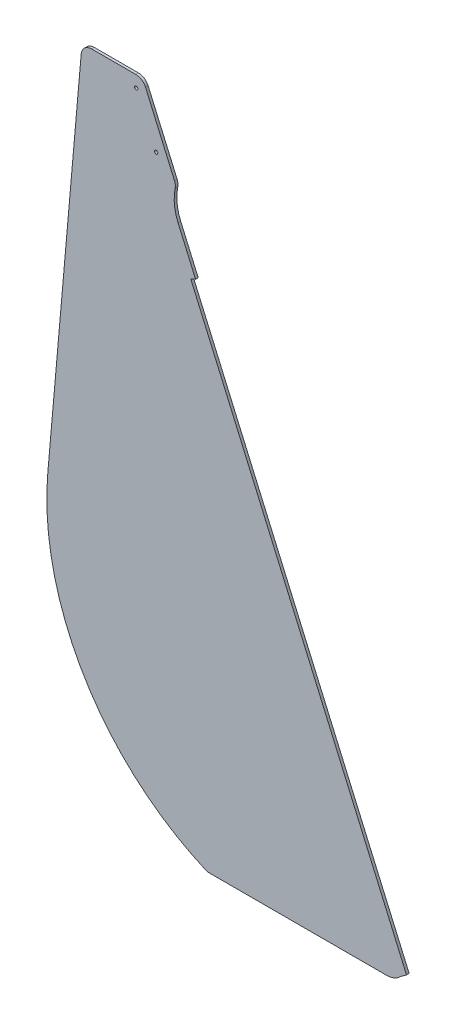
ISO-10303-21;
HEADER;
FILE_DESCRIPTION(('STEP AP214'),'2;1');
FILE_NAME('part.step','',(''),(''),'','','');
FILE_SCHEMA(('AUTOMOTIVE_DESIGN { 1 0 10303 214 1 1 1 1 }'));
ENDSEC;
DATA;
#1=APPLICATION_CONTEXT('core data for automotive mechanical design processes');
#2=APPLICATION_PROTOCOL_DEFINITION('international standard','automotive_design',2000,#1);
#3=PRODUCT_CONTEXT('',#1,'mechanical');
#4=PRODUCT('Part','Part','',(#3));
#5=PRODUCT_RELATED_PRODUCT_CATEGORY('part','',(#4));
#6=PRODUCT_DEFINITION_FORMATION('','',#4);
#7=PRODUCT_DEFINITION_CONTEXT('part definition',#1,'design');
#8=PRODUCT_DEFINITION('design','',#6,#7);
#9=PRODUCT_DEFINITION_SHAPE('','',#8);
#10=(LENGTH_UNIT() NAMED_UNIT(*) SI_UNIT(.MILLI.,.METRE.));
#11=(NAMED_UNIT(*) PLANE_ANGLE_UNIT() SI_UNIT($,.RADIAN.));
#12=(NAMED_UNIT(*) SI_UNIT($,.STERADIAN.) SOLID_ANGLE_UNIT());
#13=UNCERTAINTY_MEASURE_WITH_UNIT(LENGTH_MEASURE(1.E-05),#10,'distance_accuracy_value','');
#14=(GEOMETRIC_REPRESENTATION_CONTEXT(3) GLOBAL_UNCERTAINTY_ASSIGNED_CONTEXT((#13)) GLOBAL_UNIT_ASSIGNED_CONTEXT((#10,
#11,#12)) REPRESENTATION_CONTEXT('',''));
#15=CARTESIAN_POINT('',(0.,0.,0.));
#16=DIRECTION('',(0.,0.,1.));
#17=DIRECTION('',(1.,0.,0.));
#18=AXIS2_PLACEMENT_3D('',#15,#16,#17);
#19=CARTESIAN_POINT('',(-107.603189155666,388.77551950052,3.175));
#20=DIRECTION('',(0.,0.,-1.));
#21=DIRECTION('',(-1.,0.,0.));
#22=AXIS2_PLACEMENT_3D('',#19,#20,#21);
#23=CYLINDRICAL_SURFACE('',#22,56.7389009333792);
#24=CARTESIAN_POINT('',(-107.603189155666,388.77551950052,0.));
#25=DIRECTION('',(0.,0.,-1.));
#26=DIRECTION('',(-1.,0.,0.));
#27=AXIS2_PLACEMENT_3D('',#24,#25,#26);
#28=CIRCLE('',#27,56.7389009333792);
#29=CARTESIAN_POINT('',(-159.613848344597,366.099668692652,0.));
#30=VERTEX_POINT('',#29);
#31=CARTESIAN_POINT('',(-163.173742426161,400.230496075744,0.));
#32=VERTEX_POINT('',#31);
#33=EDGE_CURVE('E164',#30,#32,#28,.T.);
#34=ORIENTED_EDGE('',*,*,#33,.T.);
#35=DIRECTION('',(0.,0.,-1.));
#36=VECTOR('',#35,1.);
#37=CARTESIAN_POINT('',(-163.173742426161,400.230496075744,3.175));
#38=LINE('',#37,#36);
#39=CARTESIAN_POINT('',(-163.173742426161,400.230496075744,3.175));
#40=VERTEX_POINT('',#39);
#41=EDGE_CURVE('E47',#40,#32,#38,.T.);
#42=ORIENTED_EDGE('',*,*,#41,.F.);
#43=CARTESIAN_POINT('',(-107.603189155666,388.77551950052,3.175));
#44=DIRECTION('',(0.,0.,-1.));
#45=DIRECTION('',(-1.,0.,0.));
#46=AXIS2_PLACEMENT_3D('',#43,#44,#45);
#47=CIRCLE('',#46,56.7389009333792);
#48=CARTESIAN_POINT('',(-159.613848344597,366.099668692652,3.175));
#49=VERTEX_POINT('',#48);
#50=EDGE_CURVE('E315',#49,#40,#47,.T.);
#51=ORIENTED_EDGE('',*,*,#50,.F.);
#52=DIRECTION('',(0.,0.,-1.));
#53=VECTOR('',#52,1.);
#54=CARTESIAN_POINT('',(-159.613848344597,366.099668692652,3.175));
#55=LINE('',#54,#53);
#56=EDGE_CURVE('E11',#49,#30,#55,.T.);
#57=ORIENTED_EDGE('',*,*,#56,.T.);
#58=EDGE_LOOP('',(#34,#42,#51,#57));
#59=FACE_BOUND('',#58,.T.);
#60=ADVANCED_FACE('F38',(#59),#23,.F.);
#61=CARTESIAN_POINT('',(-175.612228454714,402.794490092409,3.175));
#62=DIRECTION('',(0.,0.,-1.));
#63=DIRECTION('',(-1.,0.,0.));
#64=AXIS2_PLACEMENT_3D('',#61,#62,#63);
#65=CYLINDRICAL_SURFACE('',#64,12.7);
#66=CARTESIAN_POINT('',(-175.612228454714,402.794490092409,0.));
#67=DIRECTION('',(0.,0.,1.));
#68=DIRECTION('',(1.,0.,0.));
#69=AXIS2_PLACEMENT_3D('',#66,#67,#68);
#70=CIRCLE('',#69,12.7);
#71=CARTESIAN_POINT('',(-163.970561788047,407.870078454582,0.));
#72=VERTEX_POINT('',#71);
#73=EDGE_CURVE('E167',#32,#72,#70,.T.);
#74=ORIENTED_EDGE('',*,*,#73,.T.);
#75=DIRECTION('',(0.,0.,-1.));
#76=VECTOR('',#75,1.);
#77=CARTESIAN_POINT('',(-163.970561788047,407.870078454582,3.175));
#78=LINE('',#77,#76);
#79=CARTESIAN_POINT('',(-163.970561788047,407.870078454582,3.175));
#80=VERTEX_POINT('',#79);
#81=EDGE_CURVE('E204',#80,#72,#78,.T.);
#82=ORIENTED_EDGE('',*,*,#81,.F.);
#83=CARTESIAN_POINT('',(-175.612228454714,402.794490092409,3.175));
#84=DIRECTION('',(0.,0.,1.));
#85=DIRECTION('',(1.,0.,0.));
#86=AXIS2_PLACEMENT_3D('',#83,#84,#85);
#87=CIRCLE('',#86,12.7);
#88=EDGE_CURVE('E213',#40,#80,#87,.T.);
#89=ORIENTED_EDGE('',*,*,#88,.F.);
#90=ORIENTED_EDGE('',*,*,#41,.T.);
#91=EDGE_LOOP('',(#74,#82,#89,#90));
#92=FACE_BOUND('',#91,.T.);
#93=ADVANCED_FACE('F211',(#92),#65,.T.);
#94=CARTESIAN_POINT('',(-163.970561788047,407.870078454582,3.175));
#95=DIRECTION('',(-0.916666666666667,-0.399652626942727,0.));
#96=DIRECTION('',(0.399652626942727,-0.916666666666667,0.));
#97=AXIS2_PLACEMENT_3D('',#94,#95,#96);
#98=PLANE('',#97);
#99=DIRECTION('',(-0.399652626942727,0.916666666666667,0.));
#100=VECTOR('',#99,1.);
#101=CARTESIAN_POINT('',(-163.970561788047,407.870078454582,0.));
#102=LINE('',#101,#100);
#103=CARTESIAN_POINT('',(-198.764541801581,487.675588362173,0.));
#104=VERTEX_POINT('',#103);
#105=EDGE_CURVE('E170',#72,#104,#102,.T.);
#106=ORIENTED_EDGE('',*,*,#105,.T.);
#107=DIRECTION('',(0.,0.,-1.));
#108=VECTOR('',#107,1.);
#109=CARTESIAN_POINT('',(-198.764541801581,487.675588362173,3.175));
#110=LINE('',#109,#108);
#111=CARTESIAN_POINT('',(-198.764541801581,487.675588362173,3.175));
#112=VERTEX_POINT('',#111);
#113=EDGE_CURVE('E201',#112,#104,#110,.T.);
#114=ORIENTED_EDGE('',*,*,#113,.F.);
#115=DIRECTION('',(-0.399652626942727,0.916666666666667,0.));
#116=VECTOR('',#115,1.);
#117=CARTESIAN_POINT('',(-163.970561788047,407.870078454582,3.175));
#118=LINE('',#117,#116);
#119=EDGE_CURVE('E236',#80,#112,#118,.T.);
#120=ORIENTED_EDGE('',*,*,#119,.F.);
#121=ORIENTED_EDGE('',*,*,#81,.T.);
#122=EDGE_LOOP('',(#106,#114,#120,#121));
#123=FACE_BOUND('',#122,.T.);
#124=ADVANCED_FACE('F227',(#123),#98,.F.);
#125=CARTESIAN_POINT('',(-210.406208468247,482.6,3.175));
#126=DIRECTION('',(0.,0.,-1.));
#127=DIRECTION('',(-1.,0.,0.));
#128=AXIS2_PLACEMENT_3D('',#125,#126,#127);
#129=CYLINDRICAL_SURFACE('',#128,12.6999999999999);
#130=CARTESIAN_POINT('',(-210.406208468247,482.6,0.));
#131=DIRECTION('',(0.,0.,1.));
#132=DIRECTION('',(1.,0.,0.));
#133=AXIS2_PLACEMENT_3D('',#130,#131,#132);
#134=CIRCLE('',#133,12.6999999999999);
#135=CARTESIAN_POINT('',(-210.406208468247,495.3,0.));
#136=VERTEX_POINT('',#135);
#137=EDGE_CURVE('E172',#104,#136,#134,.T.);
#138=ORIENTED_EDGE('',*,*,#137,.T.);
#139=DIRECTION('',(0.,0.,-1.));
#140=VECTOR('',#139,1.);
#141=CARTESIAN_POINT('',(-210.406208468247,495.3,3.175));
#142=LINE('',#141,#140);
#143=CARTESIAN_POINT('',(-210.406208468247,495.3,3.175));
#144=VERTEX_POINT('',#143);
#145=EDGE_CURVE('E198',#144,#136,#142,.T.);
#146=ORIENTED_EDGE('',*,*,#145,.F.);
#147=CARTESIAN_POINT('',(-210.406208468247,482.6,3.175));
#148=DIRECTION('',(0.,0.,1.));
#149=DIRECTION('',(1.,0.,0.));
#150=AXIS2_PLACEMENT_3D('',#147,#148,#149);
#151=CIRCLE('',#150,12.6999999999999);
#152=EDGE_CURVE('E233',#112,#144,#151,.T.);
#153=ORIENTED_EDGE('',*,*,#152,.F.);
#154=ORIENTED_EDGE('',*,*,#113,.T.);
#155=EDGE_LOOP('',(#138,#146,#153,#154));
#156=FACE_BOUND('',#155,.T.);
#157=ADVANCED_FACE('F231',(#156),#129,.T.);
#158=CARTESIAN_POINT('',(-263.487147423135,495.3,3.175));
#159=DIRECTION('',(0.,-1.,0.));
#160=DIRECTION('',(0.,0.,-1.));
#161=AXIS2_PLACEMENT_3D('',#158,#159,#160);
#162=PLANE('',#161);
#163=DIRECTION('',(-1.,0.,0.));
#164=VECTOR('',#163,1.);
#165=CARTESIAN_POINT('',(-263.487147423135,495.3,0.));
#166=LINE('',#165,#164);
#167=CARTESIAN_POINT('',(-263.487147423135,495.3,0.));
#168=VERTEX_POINT('',#167);
#169=EDGE_CURVE('E174',#136,#168,#166,.T.);
#170=ORIENTED_EDGE('',*,*,#169,.T.);
#171=DIRECTION('',(0.,0.,-1.));
#172=VECTOR('',#171,1.);
#173=CARTESIAN_POINT('',(-263.487147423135,495.3,3.175));
#174=LINE('',#173,#172);
#175=CARTESIAN_POINT('',(-263.487147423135,495.3,3.175));
#176=VERTEX_POINT('',#175);
#177=EDGE_CURVE('E195',#176,#168,#174,.T.);
#178=ORIENTED_EDGE('',*,*,#177,.F.);
#179=DIRECTION('',(-1.,0.,0.));
#180=VECTOR('',#179,1.);
#181=CARTESIAN_POINT('',(-263.487147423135,495.3,3.175));
#182=LINE('',#181,#180);
#183=EDGE_CURVE('E235',#144,#176,#182,.T.);
#184=ORIENTED_EDGE('',*,*,#183,.F.);
#185=ORIENTED_EDGE('',*,*,#145,.T.);
#186=EDGE_LOOP('',(#170,#178,#184,#185));
#187=FACE_BOUND('',#186,.T.);
#188=ADVANCED_FACE('F342',(#187),#162,.F.);
#189=CARTESIAN_POINT('',(-263.487147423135,482.6,3.175));
#190=DIRECTION('',(0.,0.,-1.));
#191=DIRECTION('',(-1.,0.,0.));
#192=AXIS2_PLACEMENT_3D('',#189,#190,#191);
#193=CYLINDRICAL_SURFACE('',#192,12.7);
#194=CARTESIAN_POINT('',(-263.487147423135,482.6,0.));
#195=DIRECTION('',(0.,0.,1.));
#196=DIRECTION('',(1.,0.,0.));
#197=AXIS2_PLACEMENT_3D('',#194,#195,#196);
#198=CIRCLE('',#197,12.7);
#199=CARTESIAN_POINT('',(-276.138203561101,483.713902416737,0.));
#200=VERTEX_POINT('',#199);
#201=EDGE_CURVE('E176',#168,#200,#198,.T.);
#202=ORIENTED_EDGE('',*,*,#201,.T.);
#203=DIRECTION('',(0.,0.,-1.));
#204=VECTOR('',#203,1.);
#205=CARTESIAN_POINT('',(-276.138203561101,483.713902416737,3.175));
#206=LINE('',#205,#204);
#207=CARTESIAN_POINT('',(-276.138203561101,483.713902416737,3.175));
#208=VERTEX_POINT('',#207);
#209=EDGE_CURVE('E192',#208,#200,#206,.T.);
#210=ORIENTED_EDGE('',*,*,#209,.F.);
#211=CARTESIAN_POINT('',(-263.487147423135,482.6,3.175));
#212=DIRECTION('',(0.,0.,1.));
#213=DIRECTION('',(1.,0.,0.));
#214=AXIS2_PLACEMENT_3D('',#211,#212,#213);
#215=CIRCLE('',#214,12.7);
#216=EDGE_CURVE('E238',#176,#208,#215,.T.);
#217=ORIENTED_EDGE('',*,*,#216,.F.);
#218=ORIENTED_EDGE('',*,*,#177,.T.);
#219=EDGE_LOOP('',(#202,#210,#217,#218));
#220=FACE_BOUND('',#219,.T.);
#221=ADVANCED_FACE('F247',(#220),#193,.T.);
#222=CARTESIAN_POINT('',(-276.138203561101,483.713902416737,3.175));
#223=DIRECTION('',(0.996146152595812,-0.0877088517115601,0.));
#224=DIRECTION('',(0.0877088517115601,0.996146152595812,0.));
#225=AXIS2_PLACEMENT_3D('',#222,#223,#224);
#226=PLANE('',#225);
#227=DIRECTION('',(-0.0877088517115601,-0.996146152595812,0.));
#228=VECTOR('',#227,1.);
#229=CARTESIAN_POINT('',(-276.138203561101,483.713902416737,0.));
#230=LINE('',#229,#228);
#231=CARTESIAN_POINT('',(-316.27640344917,27.8475604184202,0.));
#232=VERTEX_POINT('',#231);
#233=EDGE_CURVE('E178',#200,#232,#230,.T.);
#234=ORIENTED_EDGE('',*,*,#233,.T.);
#235=DIRECTION('',(0.,0.,-1.));
#236=VECTOR('',#235,1.);
#237=CARTESIAN_POINT('',(-316.27640344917,27.8475604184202,3.175));
#238=LINE('',#237,#236);
#239=CARTESIAN_POINT('',(-316.27640344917,27.8475604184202,3.175));
#240=VERTEX_POINT('',#239);
#241=EDGE_CURVE('E153',#240,#232,#238,.T.);
#242=ORIENTED_EDGE('',*,*,#241,.F.);
#243=DIRECTION('',(-0.0877088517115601,-0.996146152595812,0.));
#244=VECTOR('',#243,1.);
#245=CARTESIAN_POINT('',(-276.138203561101,483.713902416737,3.175));
#246=LINE('',#245,#244);
#247=EDGE_CURVE('E144',#208,#240,#246,.T.);
#248=ORIENTED_EDGE('',*,*,#247,.F.);
#249=ORIENTED_EDGE('',*,*,#209,.T.);
#250=EDGE_LOOP('',(#234,#242,#248,#249));
#251=FACE_BOUND('',#250,.T.);
#252=ADVANCED_FACE('F251',(#251),#226,.F.);
#253=CARTESIAN_POINT('',(0.,0.,3.175));
#254=DIRECTION('',(0.,0.,-1.));
#255=DIRECTION('',(-1.,0.,0.));
#256=AXIS2_PLACEMENT_3D('',#253,#254,#255);
#257=CYLINDRICAL_SURFACE('',#256,317.5);
#258=CARTESIAN_POINT('',(0.,0.,0.));
#259=DIRECTION('',(0.,0.,1.));
#260=DIRECTION('',(1.,0.,0.));
#261=AXIS2_PLACEMENT_3D('',#258,#259,#260);
#262=CIRCLE('',#261,317.5);
#263=CARTESIAN_POINT('',(-124.434078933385,-292.1,0.));
#264=VERTEX_POINT('',#263);
#265=EDGE_CURVE('E152',#232,#264,#262,.T.);
#266=ORIENTED_EDGE('',*,*,#265,.T.);
#267=DIRECTION('',(0.,0.,-1.));
#268=VECTOR('',#267,1.);
#269=CARTESIAN_POINT('',(-124.434078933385,-292.1,3.175));
#270=LINE('',#269,#268);
#271=CARTESIAN_POINT('',(-124.434078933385,-292.1,3.175));
#272=VERTEX_POINT('',#271);
#273=EDGE_CURVE('E149',#272,#264,#270,.T.);
#274=ORIENTED_EDGE('',*,*,#273,.F.);
#275=CARTESIAN_POINT('',(0.,0.,3.175));
#276=DIRECTION('',(0.,0.,1.));
#277=DIRECTION('',(1.,0.,0.));
#278=AXIS2_PLACEMENT_3D('',#275,#276,#277);
#279=CIRCLE('',#278,317.5);
#280=EDGE_CURVE('E137',#240,#272,#279,.T.);
#281=ORIENTED_EDGE('',*,*,#280,.F.);
#282=ORIENTED_EDGE('',*,*,#241,.T.);
#283=EDGE_LOOP('',(#266,#274,#281,#282));
#284=FACE_BOUND('',#283,.T.);
#285=ADVANCED_FACE('F150',(#284),#257,.T.);
#286=CARTESIAN_POINT('',(-124.434078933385,-292.1,3.175));
#287=DIRECTION('',(0.,1.,0.));
#288=DIRECTION('',(-1.,0.,0.));
#289=AXIS2_PLACEMENT_3D('',#286,#287,#288);
#290=PLANE('',#289);
#291=DIRECTION('',(1.,0.,0.));
#292=VECTOR('',#291,1.);
#293=CARTESIAN_POINT('',(-124.434078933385,-292.1,0.));
#294=LINE('',#293,#292);
#295=CARTESIAN_POINT('',(91.44,-292.1,0.));
#296=VERTEX_POINT('',#295);
#297=EDGE_CURVE('E95',#264,#296,#294,.T.);
#298=ORIENTED_EDGE('',*,*,#297,.T.);
#299=DIRECTION('',(0.,0.,-1.));
#300=VECTOR('',#299,1.);
#301=CARTESIAN_POINT('',(91.44,-292.1,3.175));
#302=LINE('',#301,#300);
#303=CARTESIAN_POINT('',(91.44,-292.1,3.175));
#304=VERTEX_POINT('',#303);
#305=EDGE_CURVE('E154',#304,#296,#302,.T.);
#306=ORIENTED_EDGE('',*,*,#305,.F.);
#307=DIRECTION('',(1.,0.,0.));
#308=VECTOR('',#307,1.);
#309=CARTESIAN_POINT('',(-124.434078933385,-292.1,3.175));
#310=LINE('',#309,#308);
#311=EDGE_CURVE('E142',#272,#304,#310,.T.);
#312=ORIENTED_EDGE('',*,*,#311,.F.);
#313=ORIENTED_EDGE('',*,*,#273,.T.);
#314=EDGE_LOOP('',(#298,#306,#312,#313));
#315=FACE_BOUND('',#314,.T.);
#316=ADVANCED_FACE('F156',(#315),#290,.F.);
#317=CARTESIAN_POINT('',(91.44,-269.875,3.175));
#318=DIRECTION('',(0.,0.,-1.));
#319=DIRECTION('',(-1.,0.,0.));
#320=AXIS2_PLACEMENT_3D('',#317,#318,#319);
#321=CYLINDRICAL_SURFACE('',#320,22.225);
#322=CARTESIAN_POINT('',(91.44,-269.875,0.));
#323=DIRECTION('',(0.,0.,1.));
#324=DIRECTION('',(1.,0.,0.));
#325=AXIS2_PLACEMENT_3D('',#322,#323,#324);
#326=CIRCLE('',#325,22.225);
#327=CARTESIAN_POINT('',(107.309314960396,-285.435060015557,0.));
#328=VERTEX_POINT('',#327);
#329=EDGE_CURVE('E101',#296,#328,#326,.T.);
#330=ORIENTED_EDGE('',*,*,#329,.T.);
#331=DIRECTION('',(0.,0.,-1.));
#332=VECTOR('',#331,1.);
#333=CARTESIAN_POINT('',(107.309314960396,-285.435060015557,3.175));
#334=LINE('',#333,#332);
#335=CARTESIAN_POINT('',(107.309314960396,-285.435060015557,3.175));
#336=VERTEX_POINT('',#335);
#337=EDGE_CURVE('E163',#336,#328,#334,.T.);
#338=ORIENTED_EDGE('',*,*,#337,.F.);
#339=CARTESIAN_POINT('',(91.44,-269.875,3.175));
#340=DIRECTION('',(0.,0.,1.));
#341=DIRECTION('',(1.,0.,0.));
#342=AXIS2_PLACEMENT_3D('',#339,#340,#341);
#343=CIRCLE('',#342,22.225);
#344=EDGE_CURVE('E55',#304,#336,#343,.T.);
#345=ORIENTED_EDGE('',*,*,#344,.F.);
#346=ORIENTED_EDGE('',*,*,#305,.T.);
#347=EDGE_LOOP('',(#330,#338,#345,#346));
#348=FACE_BOUND('',#347,.T.);
#349=ADVANCED_FACE('F328',(#348),#321,.T.);
#350=CARTESIAN_POINT('',(107.309314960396,-285.435060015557,3.175));
#351=DIRECTION('',(-0.595364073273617,0.803456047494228,0.));
#352=DIRECTION('',(-0.803456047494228,-0.595364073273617,0.));
#353=AXIS2_PLACEMENT_3D('',#350,#351,#352);
#354=PLANE('',#353);
#355=DIRECTION('',(0.803456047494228,0.595364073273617,0.));
#356=VECTOR('',#355,1.);
#357=CARTESIAN_POINT('',(107.309314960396,-285.435060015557,0.));
#358=LINE('',#357,#356);
#359=CARTESIAN_POINT('',(115.025274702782,-279.7175036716,0.));
#360=VERTEX_POINT('',#359);
#361=EDGE_CURVE('E183',#328,#360,#358,.T.);
#362=ORIENTED_EDGE('',*,*,#361,.T.);
#363=DIRECTION('',(0.,0.,1.));
#364=VECTOR('',#363,1.);
#365=CARTESIAN_POINT('',(115.025274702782,-279.717503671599,3.175));
#366=LINE('',#365,#364);
#367=CARTESIAN_POINT('',(115.025274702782,-279.7175036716,3.175));
#368=VERTEX_POINT('',#367);
#369=EDGE_CURVE('E263',#360,#368,#366,.T.);
#370=ORIENTED_EDGE('',*,*,#369,.T.);
#371=DIRECTION('',(0.803456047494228,0.595364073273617,0.));
#372=VECTOR('',#371,1.);
#373=CARTESIAN_POINT('',(107.309314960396,-285.435060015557,3.175));
#374=LINE('',#373,#372);
#375=EDGE_CURVE('E158',#336,#368,#374,.T.);
#376=ORIENTED_EDGE('',*,*,#375,.F.);
#377=ORIENTED_EDGE('',*,*,#337,.T.);
#378=EDGE_LOOP('',(#362,#370,#376,#377));
#379=FACE_BOUND('',#378,.T.);
#380=ADVANCED_FACE('F260',(#379),#354,.F.);
#381=CARTESIAN_POINT('',(116.277115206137,-266.7,3.175));
#382=DIRECTION('',(-0.916666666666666,-0.399652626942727,0.));
#383=DIRECTION('',(0.399652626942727,-0.916666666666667,0.));
#384=AXIS2_PLACEMENT_3D('',#381,#382,#383);
#385=PLANE('',#384);
#386=DIRECTION('',(-0.399652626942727,0.916666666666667,0.));
#387=VECTOR('',#386,1.);
#388=CARTESIAN_POINT('',(0.,0.,3.175));
#389=LINE('',#388,#387);
#390=CARTESIAN_POINT('',(-138.593960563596,317.887223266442,3.175));
#391=VERTEX_POINT('',#390);
#392=EDGE_CURVE('E111',#391,#49,#389,.T.);
#393=ORIENTED_EDGE('',*,*,#392,.F.);
#394=DIRECTION('',(0.,0.,1.));
#395=VECTOR('',#394,1.);
#396=CARTESIAN_POINT('',(-138.593960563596,317.887223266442,0.));
#397=LINE('',#396,#395);
#398=CARTESIAN_POINT('',(-138.593960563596,317.887223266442,0.));
#399=VERTEX_POINT('',#398);
#400=EDGE_CURVE('E283',#399,#391,#397,.T.);
#401=ORIENTED_EDGE('',*,*,#400,.F.);
#402=DIRECTION('',(-0.399652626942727,0.916666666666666,0.));
#403=VECTOR('',#402,1.);
#404=CARTESIAN_POINT('',(116.277115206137,-266.7,0.));
#405=LINE('',#404,#403);
#406=EDGE_CURVE('E186',#399,#30,#405,.T.);
#407=ORIENTED_EDGE('',*,*,#406,.T.);
#408=ORIENTED_EDGE('',*,*,#56,.F.);
#409=EDGE_LOOP('',(#393,#401,#407,#408));
#410=FACE_BOUND('',#409,.T.);
#411=ADVANCED_FACE('F318',(#410),#385,.F.);
#412=CARTESIAN_POINT('',(-107.603189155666,388.77551950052,3.175));
#413=DIRECTION('',(0.,0.,-1.));
#414=DIRECTION('',(-1.,0.,0.));
#415=AXIS2_PLACEMENT_3D('',#412,#413,#414);
#416=PLANE('',#415);
#417=ORIENTED_EDGE('',*,*,#375,.T.);
#418=DIRECTION('',(0.399652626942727,-0.916666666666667,0.));
#419=VECTOR('',#418,1.);
#420=CARTESIAN_POINT('',(114.440212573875,-278.375570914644,3.175));
#421=LINE('',#420,#419);
#422=CARTESIAN_POINT('',(-144.414793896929,315.349429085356,3.175));
#423=VERTEX_POINT('',#422);
#424=EDGE_CURVE('E291',#423,#368,#421,.T.);
#425=ORIENTED_EDGE('',*,*,#424,.F.);
#426=DIRECTION('',(0.916666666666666,0.399652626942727,0.));
#427=VECTOR('',#426,1.);
#428=CARTESIAN_POINT('',(-144.414793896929,315.349429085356,3.175));
#429=LINE('',#428,#427);
#430=EDGE_CURVE('E278',#423,#391,#429,.T.);
#431=ORIENTED_EDGE('',*,*,#430,.T.);
#432=ORIENTED_EDGE('',*,*,#392,.T.);
#433=ORIENTED_EDGE('',*,*,#50,.T.);
#434=ORIENTED_EDGE('',*,*,#88,.T.);
#435=ORIENTED_EDGE('',*,*,#119,.T.);
#436=ORIENTED_EDGE('',*,*,#152,.T.);
#437=ORIENTED_EDGE('',*,*,#183,.T.);
#438=ORIENTED_EDGE('',*,*,#216,.T.);
#439=ORIENTED_EDGE('',*,*,#247,.T.);
#440=ORIENTED_EDGE('',*,*,#280,.T.);
#441=ORIENTED_EDGE('',*,*,#311,.T.);
#442=ORIENTED_EDGE('',*,*,#344,.T.);
#443=EDGE_LOOP('',(#417,#425,#431,#432,#433,#434,#435,#436,#437,#438,#439,#440,#441,#442));
#444=FACE_BOUND('',#443,.T.);
#445=CARTESIAN_POINT('',(-209.948424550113,481.55,3.175));
#446=DIRECTION('',(0.,0.,1.));
#447=DIRECTION('',(1.,0.,0.));
#448=AXIS2_PLACEMENT_3D('',#445,#446,#447);
#449=CIRCLE('',#448,2.);
#450=CARTESIAN_POINT('',(-207.948424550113,481.55,3.175));
#451=VERTEX_POINT('',#450);
#452=EDGE_CURVE('E286',#451,#451,#449,.T.);
#453=ORIENTED_EDGE('',*,*,#452,.F.);
#454=EDGE_LOOP('',(#453));
#455=FACE_BOUND('',#454,.T.);
#456=CARTESIAN_POINT('',(-185.969266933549,426.55,3.175));
#457=DIRECTION('',(0.,0.,1.));
#458=DIRECTION('',(1.,0.,0.));
#459=AXIS2_PLACEMENT_3D('',#456,#457,#458);
#460=CIRCLE('',#459,2.);
#461=CARTESIAN_POINT('',(-183.969266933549,426.55,3.175));
#462=VERTEX_POINT('',#461);
#463=EDGE_CURVE('E306',#462,#462,#460,.T.);
#464=ORIENTED_EDGE('',*,*,#463,.F.);
#465=EDGE_LOOP('',(#464));
#466=FACE_BOUND('',#465,.T.);
#467=ADVANCED_FACE('F139',(#444,#455,#466),#416,.F.);
#468=CARTESIAN_POINT('',(-107.603189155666,388.77551950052,0.));
#469=DIRECTION('',(0.,0.,-1.));
#470=DIRECTION('',(-1.,0.,0.));
#471=AXIS2_PLACEMENT_3D('',#468,#469,#470);
#472=PLANE('',#471);
#473=DIRECTION('',(-0.399652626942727,0.916666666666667,0.));
#474=VECTOR('',#473,1.);
#475=CARTESIAN_POINT('',(114.440212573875,-278.375570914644,0.));
#476=LINE('',#475,#474);
#477=CARTESIAN_POINT('',(-144.414793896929,315.349429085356,0.));
#478=VERTEX_POINT('',#477);
#479=EDGE_CURVE('E256',#360,#478,#476,.T.);
#480=ORIENTED_EDGE('',*,*,#479,.F.);
#481=ORIENTED_EDGE('',*,*,#361,.F.);
#482=ORIENTED_EDGE('',*,*,#329,.F.);
#483=ORIENTED_EDGE('',*,*,#297,.F.);
#484=ORIENTED_EDGE('',*,*,#265,.F.);
#485=ORIENTED_EDGE('',*,*,#233,.F.);
#486=ORIENTED_EDGE('',*,*,#201,.F.);
#487=ORIENTED_EDGE('',*,*,#169,.F.);
#488=ORIENTED_EDGE('',*,*,#137,.F.);
#489=ORIENTED_EDGE('',*,*,#105,.F.);
#490=ORIENTED_EDGE('',*,*,#73,.F.);
#491=ORIENTED_EDGE('',*,*,#33,.F.);
#492=ORIENTED_EDGE('',*,*,#406,.F.);
#493=DIRECTION('',(0.916666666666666,0.399652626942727,0.));
#494=VECTOR('',#493,1.);
#495=CARTESIAN_POINT('',(-144.414793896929,315.349429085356,0.));
#496=LINE('',#495,#494);
#497=EDGE_CURVE('E287',#478,#399,#496,.T.);
#498=ORIENTED_EDGE('',*,*,#497,.F.);
#499=EDGE_LOOP('',(#480,#481,#482,#483,#484,#485,#486,#487,#488,#489,#490,#491,#492,#498));
#500=FACE_BOUND('',#499,.T.);
#501=CARTESIAN_POINT('',(-209.948424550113,481.55,0.));
#502=DIRECTION('',(0.,0.,1.));
#503=DIRECTION('',(1.,0.,0.));
#504=AXIS2_PLACEMENT_3D('',#501,#502,#503);
#505=CIRCLE('',#504,2.);
#506=CARTESIAN_POINT('',(-207.948424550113,481.55,0.));
#507=VERTEX_POINT('',#506);
#508=EDGE_CURVE('E303',#507,#507,#505,.T.);
#509=ORIENTED_EDGE('',*,*,#508,.T.);
#510=EDGE_LOOP('',(#509));
#511=FACE_BOUND('',#510,.T.);
#512=CARTESIAN_POINT('',(-185.969266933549,426.55,0.));
#513=DIRECTION('',(0.,0.,1.));
#514=DIRECTION('',(1.,0.,0.));
#515=AXIS2_PLACEMENT_3D('',#512,#513,#514);
#516=CIRCLE('',#515,2.);
#517=CARTESIAN_POINT('',(-183.969266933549,426.55,0.));
#518=VERTEX_POINT('',#517);
#519=EDGE_CURVE('E168',#518,#518,#516,.T.);
#520=ORIENTED_EDGE('',*,*,#519,.T.);
#521=EDGE_LOOP('',(#520));
#522=FACE_BOUND('',#521,.T.);
#523=ADVANCED_FACE('F220',(#500,#511,#522),#472,.T.);
#524=CARTESIAN_POINT('',(-185.969266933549,426.55,0.));
#525=DIRECTION('',(0.,0.,1.));
#526=DIRECTION('',(1.,0.,0.));
#527=AXIS2_PLACEMENT_3D('',#524,#525,#526);
#528=CYLINDRICAL_SURFACE('',#527,2.);
#529=ORIENTED_EDGE('',*,*,#519,.F.);
#530=EDGE_LOOP('',(#529));
#531=FACE_BOUND('',#530,.T.);
#532=ORIENTED_EDGE('',*,*,#463,.T.);
#533=EDGE_LOOP('',(#532));
#534=FACE_BOUND('',#533,.T.);
#535=ADVANCED_FACE('F386',(#531,#534),#528,.F.);
#536=CARTESIAN_POINT('',(-209.948424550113,481.55,0.));
#537=DIRECTION('',(0.,0.,1.));
#538=DIRECTION('',(1.,0.,0.));
#539=AXIS2_PLACEMENT_3D('',#536,#537,#538);
#540=CYLINDRICAL_SURFACE('',#539,2.);
#541=ORIENTED_EDGE('',*,*,#508,.F.);
#542=EDGE_LOOP('',(#541));
#543=FACE_BOUND('',#542,.T.);
#544=ORIENTED_EDGE('',*,*,#452,.T.);
#545=EDGE_LOOP('',(#544));
#546=FACE_BOUND('',#545,.T.);
#547=ADVANCED_FACE('F403',(#543,#546),#540,.F.);
#548=CARTESIAN_POINT('',(-144.414793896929,315.349429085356,0.));
#549=DIRECTION('',(-0.399652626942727,0.916666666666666,0.));
#550=DIRECTION('',(-0.916666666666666,-0.399652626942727,0.));
#551=AXIS2_PLACEMENT_3D('',#548,#549,#550);
#552=PLANE('',#551);
#553=ORIENTED_EDGE('',*,*,#400,.T.);
#554=ORIENTED_EDGE('',*,*,#430,.F.);
#555=DIRECTION('',(0.,0.,1.));
#556=VECTOR('',#555,1.);
#557=CARTESIAN_POINT('',(-144.414793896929,315.349429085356,0.));
#558=LINE('',#557,#556);
#559=EDGE_CURVE('E281',#478,#423,#558,.T.);
#560=ORIENTED_EDGE('',*,*,#559,.F.);
#561=ORIENTED_EDGE('',*,*,#497,.T.);
#562=EDGE_LOOP('',(#553,#554,#560,#561));
#563=FACE_BOUND('',#562,.T.);
#564=ADVANCED_FACE('F280',(#563),#552,.F.);
#565=CARTESIAN_POINT('',(-5.82083333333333,-2.53779418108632,0.));
#566=DIRECTION('',(0.916666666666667,0.399652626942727,0.));
#567=DIRECTION('',(-0.399652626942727,0.916666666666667,0.));
#568=AXIS2_PLACEMENT_3D('',#565,#566,#567);
#569=PLANE('',#568);
#570=ORIENTED_EDGE('',*,*,#479,.T.);
#571=ORIENTED_EDGE('',*,*,#559,.T.);
#572=ORIENTED_EDGE('',*,*,#424,.T.);
#573=ORIENTED_EDGE('',*,*,#369,.F.);
#574=EDGE_LOOP('',(#570,#571,#572,#573));
#575=FACE_BOUND('',#574,.T.);
#576=ADVANCED_FACE('F290',(#575),#569,.T.);
#577=CLOSED_SHELL('',(#60,#93,#124,#157,#188,#221,#252,#285,#316,#349,#380,#411,#467,#523,#535,
#547,#564,#576));
#578=MANIFOLD_SOLID_BREP('B2',#577);
#579=ADVANCED_BREP_SHAPE_REPRESENTATION('',(#18,#578),#14);
#580=SHAPE_DEFINITION_REPRESENTATION(#9,#579);
ENDSEC;
END-ISO-10303-21;
